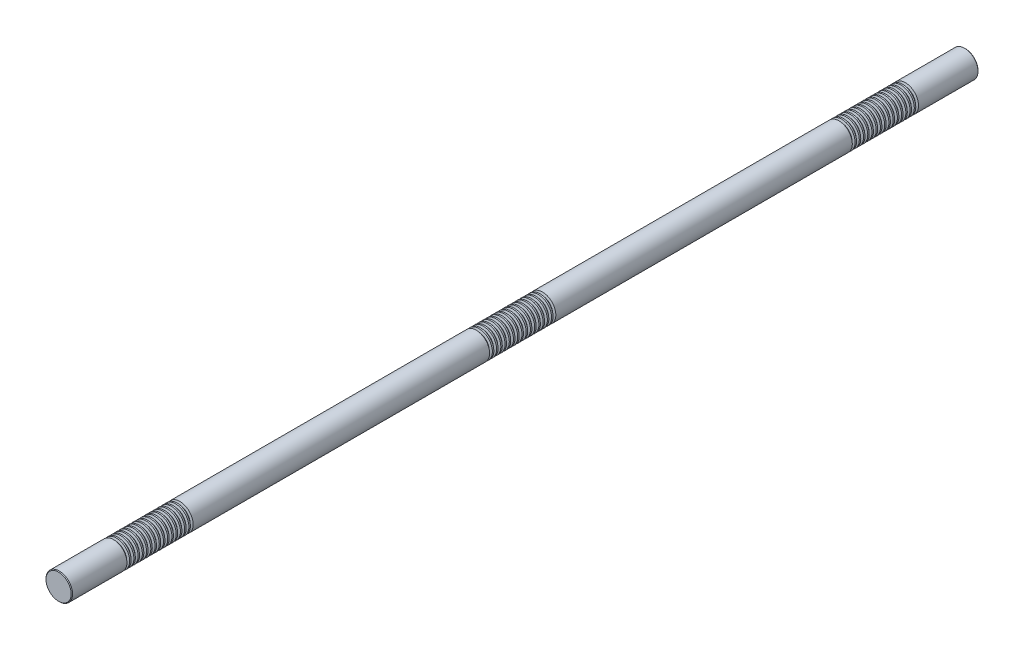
from build123d import *

# Parameters (mm, degrees)
SKETCH1_R           = 22
BOSS_EXTRUDE1_DEPTH = 750
CHAMFER1_SIZE       = 1.1
LPATTERN1_COUNT     = 16
LPATTERN1_PITCH     = 7
LPATTERN2_COUNT     = 3
LPATTERN2_PITCH     = 600


with BuildPart() as part:
    # Sketch1 → Boss-Extrude1 (new, symmetric)
    with BuildSketch(Plane.XY):
        Circle(SKETCH1_R)
    extrude(amount=BOSS_EXTRUDE1_DEPTH, both=True)

    # Chamfer1
    chamfer1_edges = [part.edges().sort_by_distance(p)[0] for p in [
        (-22, 0, -750),
        (-22, 0, 750),
    ]]
    chamfer(chamfer1_edges, length=CHAMFER1_SIZE)

    # Sketch2 → Cut-Revolve1 (revolve, cut)
    with BuildSketch(Plane(origin=(0, 0, 0), x_dir=(0, 0, -1), z_dir=(1, 0, 0)), mode=Mode.PRIVATE) as cut_revolve1_sk:
        Polygon((650.535898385, 22), (645.964101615, 22), (647.035898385, 18), (649.464101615, 18), align=None)
    cut_revolve1 = revolve(cut_revolve1_sk.sketch.rotate(Axis((0, 0, 750), (0, 0, -1)), 90), axis=Axis((0, 0, 750), (0, 0, -1)), mode=Mode.SUBTRACT)

    # LPattern1: Cut-Revolve1 ×16
    with Locations(*[(0, 0, i * LPATTERN1_PITCH) for i in range(1, LPATTERN1_COUNT)]):
        add(cut_revolve1, mode=Mode.SUBTRACT)

    # LPattern2: Cut-Revolve1 ×3
    with Locations(*[(0, 0, i * LPATTERN2_PITCH) for i in range(1, LPATTERN2_COUNT)]):
        add(cut_revolve1, mode=Mode.SUBTRACT)

    # LPattern2 copy 1 sketch → LPattern2 copy 1 (revolve, cut)
    with BuildSketch(Plane(origin=(0, 0, 607), x_dir=(0, 0, -1), z_dir=(1, 0, 0))):
        Polygon((650.535898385, 22), (645.964101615, 22), (647.035898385, 18), (649.464101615, 18), align=None)
    revolve(axis=Axis((0, 0, 1357), (0, 0, -1)), mode=Mode.SUBTRACT)

    # LPattern2 copy 2 sketch → LPattern2 copy 2 (revolve, cut)
    with BuildSketch(Plane(origin=(0, 0, 1207), x_dir=(0, 0, -1), z_dir=(1, 0, 0))):
        Polygon((650.535898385, 22), (645.964101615, 22), (647.035898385, 18), (649.464101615, 18), align=None)
    revolve(axis=Axis((0, 0, 1957), (0, 0, -1)), mode=Mode.SUBTRACT)

    # LPattern2 copy 3 sketch → LPattern2 copy 3 (revolve, cut)
    with BuildSketch(Plane(origin=(0, 0, 614), x_dir=(0, 0, -1), z_dir=(1, 0, 0))):
        Polygon((650.535898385, 22), (645.964101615, 22), (647.035898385, 18), (649.464101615, 18), align=None)
    revolve(axis=Axis((0, 0, 1364), (0, 0, -1)), mode=Mode.SUBTRACT)

    # LPattern2 copy 4 sketch → LPattern2 copy 4 (revolve, cut)
    with BuildSketch(Plane(origin=(0, 0, 1214), x_dir=(0, 0, -1), z_dir=(1, 0, 0))):
        Polygon((650.535898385, 22), (645.964101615, 22), (647.035898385, 18), (649.464101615, 18), align=None)
    revolve(axis=Axis((0, 0, 1964), (0, 0, -1)), mode=Mode.SUBTRACT)

    # LPattern2 copy 5 sketch → LPattern2 copy 5 (revolve, cut)
    with BuildSketch(Plane(origin=(0, 0, 621), x_dir=(0, 0, -1), z_dir=(1, 0, 0))):
        Polygon((650.535898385, 22), (645.964101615, 22), (647.035898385, 18), (649.464101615, 18), align=None)
    revolve(axis=Axis((0, 0, 1371), (0, 0, -1)), mode=Mode.SUBTRACT)

    # LPattern2 copy 6 sketch → LPattern2 copy 6 (revolve, cut)
    with BuildSketch(Plane(origin=(0, 0, 1221), x_dir=(0, 0, -1), z_dir=(1, 0, 0))):
        Polygon((650.535898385, 22), (645.964101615, 22), (647.035898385, 18), (649.464101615, 18), align=None)
    revolve(axis=Axis((0, 0, 1971), (0, 0, -1)), mode=Mode.SUBTRACT)

    # LPattern2 copy 7 sketch → LPattern2 copy 7 (revolve, cut)
    with BuildSketch(Plane(origin=(0, 0, 628), x_dir=(0, 0, -1), z_dir=(1, 0, 0))):
        Polygon((650.535898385, 22), (645.964101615, 22), (647.035898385, 18), (649.464101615, 18), align=None)
    revolve(axis=Axis((0, 0, 1378), (0, 0, -1)), mode=Mode.SUBTRACT)

    # LPattern2 copy 8 sketch → LPattern2 copy 8 (revolve, cut)
    with BuildSketch(Plane(origin=(0, 0, 1228), x_dir=(0, 0, -1), z_dir=(1, 0, 0))):
        Polygon((650.535898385, 22), (645.964101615, 22), (647.035898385, 18), (649.464101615, 18), align=None)
    revolve(axis=Axis((0, 0, 1978), (0, 0, -1)), mode=Mode.SUBTRACT)

    # LPattern2 copy 9 sketch → LPattern2 copy 9 (revolve, cut)
    with BuildSketch(Plane(origin=(0, 0, 635), x_dir=(0, 0, -1), z_dir=(1, 0, 0))):
        Polygon((650.535898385, 22), (645.964101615, 22), (647.035898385, 18), (649.464101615, 18), align=None)
    revolve(axis=Axis((0, 0, 1385), (0, 0, -1)), mode=Mode.SUBTRACT)

    # LPattern2 copy 10 sketch → LPattern2 copy 10 (revolve, cut)
    with BuildSketch(Plane(origin=(0, 0, 1235), x_dir=(0, 0, -1), z_dir=(1, 0, 0))):
        Polygon((650.535898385, 22), (645.964101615, 22), (647.035898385, 18), (649.464101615, 18), align=None)
    revolve(axis=Axis((0, 0, 1985), (0, 0, -1)), mode=Mode.SUBTRACT)

    # LPattern2 copy 11 sketch → LPattern2 copy 11 (revolve, cut)
    with BuildSketch(Plane(origin=(0, 0, 642), x_dir=(0, 0, -1), z_dir=(1, 0, 0))):
        Polygon((650.535898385, 22), (645.964101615, 22), (647.035898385, 18), (649.464101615, 18), align=None)
    revolve(axis=Axis((0, 0, 1392), (0, 0, -1)), mode=Mode.SUBTRACT)

    # LPattern2 copy 12 sketch → LPattern2 copy 12 (revolve, cut)
    with BuildSketch(Plane(origin=(0, 0, 1242), x_dir=(0, 0, -1), z_dir=(1, 0, 0))):
        Polygon((650.535898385, 22), (645.964101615, 22), (647.035898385, 18), (649.464101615, 18), align=None)
    revolve(axis=Axis((0, 0, 1992), (0, 0, -1)), mode=Mode.SUBTRACT)

    # LPattern2 copy 13 sketch → LPattern2 copy 13 (revolve, cut)
    with BuildSketch(Plane(origin=(0, 0, 649), x_dir=(0, 0, -1), z_dir=(1, 0, 0))):
        Polygon((650.535898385, 22), (645.964101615, 22), (647.035898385, 18), (649.464101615, 18), align=None)
    revolve(axis=Axis((0, 0, 1399), (0, 0, -1)), mode=Mode.SUBTRACT)

    # LPattern2 copy 14 sketch → LPattern2 copy 14 (revolve, cut)
    with BuildSketch(Plane(origin=(0, 0, 1249), x_dir=(0, 0, -1), z_dir=(1, 0, 0))):
        Polygon((650.535898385, 22), (645.964101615, 22), (647.035898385, 18), (649.464101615, 18), align=None)
    revolve(axis=Axis((0, 0, 1999), (0, 0, -1)), mode=Mode.SUBTRACT)

    # LPattern2 copy 15 sketch → LPattern2 copy 15 (revolve, cut)
    with BuildSketch(Plane(origin=(0, 0, 656), x_dir=(0, 0, -1), z_dir=(1, 0, 0))):
        Polygon((650.535898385, 22), (645.964101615, 22), (647.035898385, 18), (649.464101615, 18), align=None)
    revolve(axis=Axis((0, 0, 1406), (0, 0, -1)), mode=Mode.SUBTRACT)

    # LPattern2 copy 16 sketch → LPattern2 copy 16 (revolve, cut)
    with BuildSketch(Plane(origin=(0, 0, 1256), x_dir=(0, 0, -1), z_dir=(1, 0, 0))):
        Polygon((650.535898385, 22), (645.964101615, 22), (647.035898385, 18), (649.464101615, 18), align=None)
    revolve(axis=Axis((0, 0, 2006), (0, 0, -1)), mode=Mode.SUBTRACT)

    # LPattern2 copy 17 sketch → LPattern2 copy 17 (revolve, cut)
    with BuildSketch(Plane(origin=(0, 0, 663), x_dir=(0, 0, -1), z_dir=(1, 0, 0))):
        Polygon((650.535898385, 22), (645.964101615, 22), (647.035898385, 18), (649.464101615, 18), align=None)
    revolve(axis=Axis((0, 0, 1413), (0, 0, -1)), mode=Mode.SUBTRACT)

    # LPattern2 copy 18 sketch → LPattern2 copy 18 (revolve, cut)
    with BuildSketch(Plane(origin=(0, 0, 1263), x_dir=(0, 0, -1), z_dir=(1, 0, 0))):
        Polygon((650.535898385, 22), (645.964101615, 22), (647.035898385, 18), (649.464101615, 18), align=None)
    revolve(axis=Axis((0, 0, 2013), (0, 0, -1)), mode=Mode.SUBTRACT)

    # LPattern2 copy 19 sketch → LPattern2 copy 19 (revolve, cut)
    with BuildSketch(Plane(origin=(0, 0, 670), x_dir=(0, 0, -1), z_dir=(1, 0, 0))):
        Polygon((650.535898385, 22), (645.964101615, 22), (647.035898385, 18), (649.464101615, 18), align=None)
    revolve(axis=Axis((0, 0, 1420), (0, 0, -1)), mode=Mode.SUBTRACT)

    # LPattern2 copy 20 sketch → LPattern2 copy 20 (revolve, cut)
    with BuildSketch(Plane(origin=(0, 0, 1270), x_dir=(0, 0, -1), z_dir=(1, 0, 0))):
        Polygon((650.535898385, 22), (645.964101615, 22), (647.035898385, 18), (649.464101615, 18), align=None)
    revolve(axis=Axis((0, 0, 2020), (0, 0, -1)), mode=Mode.SUBTRACT)

    # LPattern2 copy 21 sketch → LPattern2 copy 21 (revolve, cut)
    with BuildSketch(Plane(origin=(0, 0, 677), x_dir=(0, 0, -1), z_dir=(1, 0, 0))):
        Polygon((650.535898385, 22), (645.964101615, 22), (647.035898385, 18), (649.464101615, 18), align=None)
    revolve(axis=Axis((0, 0, 1427), (0, 0, -1)), mode=Mode.SUBTRACT)

    # LPattern2 copy 22 sketch → LPattern2 copy 22 (revolve, cut)
    with BuildSketch(Plane(origin=(0, 0, 1277), x_dir=(0, 0, -1), z_dir=(1, 0, 0))):
        Polygon((650.535898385, 22), (645.964101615, 22), (647.035898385, 18), (649.464101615, 18), align=None)
    revolve(axis=Axis((0, 0, 2027), (0, 0, -1)), mode=Mode.SUBTRACT)

    # LPattern2 copy 23 sketch → LPattern2 copy 23 (revolve, cut)
    with BuildSketch(Plane(origin=(0, 0, 684), x_dir=(0, 0, -1), z_dir=(1, 0, 0))):
        Polygon((650.535898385, 22), (645.964101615, 22), (647.035898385, 18), (649.464101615, 18), align=None)
    revolve(axis=Axis((0, 0, 1434), (0, 0, -1)), mode=Mode.SUBTRACT)

    # LPattern2 copy 24 sketch → LPattern2 copy 24 (revolve, cut)
    with BuildSketch(Plane(origin=(0, 0, 1284), x_dir=(0, 0, -1), z_dir=(1, 0, 0))):
        Polygon((650.535898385, 22), (645.964101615, 22), (647.035898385, 18), (649.464101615, 18), align=None)
    revolve(axis=Axis((0, 0, 2034), (0, 0, -1)), mode=Mode.SUBTRACT)

    # LPattern2 copy 25 sketch → LPattern2 copy 25 (revolve, cut)
    with BuildSketch(Plane(origin=(0, 0, 691), x_dir=(0, 0, -1), z_dir=(1, 0, 0))):
        Polygon((650.535898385, 22), (645.964101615, 22), (647.035898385, 18), (649.464101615, 18), align=None)
    revolve(axis=Axis((0, 0, 1441), (0, 0, -1)), mode=Mode.SUBTRACT)

    # LPattern2 copy 26 sketch → LPattern2 copy 26 (revolve, cut)
    with BuildSketch(Plane(origin=(0, 0, 1291), x_dir=(0, 0, -1), z_dir=(1, 0, 0))):
        Polygon((650.535898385, 22), (645.964101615, 22), (647.035898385, 18), (649.464101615, 18), align=None)
    revolve(axis=Axis((0, 0, 2041), (0, 0, -1)), mode=Mode.SUBTRACT)

    # LPattern2 copy 27 sketch → LPattern2 copy 27 (revolve, cut)
    with BuildSketch(Plane(origin=(0, 0, 698), x_dir=(0, 0, -1), z_dir=(1, 0, 0))):
        Polygon((650.535898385, 22), (645.964101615, 22), (647.035898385, 18), (649.464101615, 18), align=None)
    revolve(axis=Axis((0, 0, 1448), (0, 0, -1)), mode=Mode.SUBTRACT)

    # LPattern2 copy 28 sketch → LPattern2 copy 28 (revolve, cut)
    with BuildSketch(Plane(origin=(0, 0, 1298), x_dir=(0, 0, -1), z_dir=(1, 0, 0))):
        Polygon((650.535898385, 22), (645.964101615, 22), (647.035898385, 18), (649.464101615, 18), align=None)
    revolve(axis=Axis((0, 0, 2048), (0, 0, -1)), mode=Mode.SUBTRACT)

    # LPattern2 copy 29 sketch → LPattern2 copy 29 (revolve, cut)
    with BuildSketch(Plane(origin=(0, 0, 705), x_dir=(0, 0, -1), z_dir=(1, 0, 0))):
        Polygon((650.535898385, 22), (645.964101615, 22), (647.035898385, 18), (649.464101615, 18), align=None)
    revolve(axis=Axis((0, 0, 1455), (0, 0, -1)), mode=Mode.SUBTRACT)

    # LPattern2 copy 30 sketch → LPattern2 copy 30 (revolve, cut)
    with BuildSketch(Plane(origin=(0, 0, 1305), x_dir=(0, 0, -1), z_dir=(1, 0, 0))):
        Polygon((650.535898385, 22), (645.964101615, 22), (647.035898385, 18), (649.464101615, 18), align=None)
    revolve(axis=Axis((0, 0, 2055), (0, 0, -1)), mode=Mode.SUBTRACT)


solid = part.part
